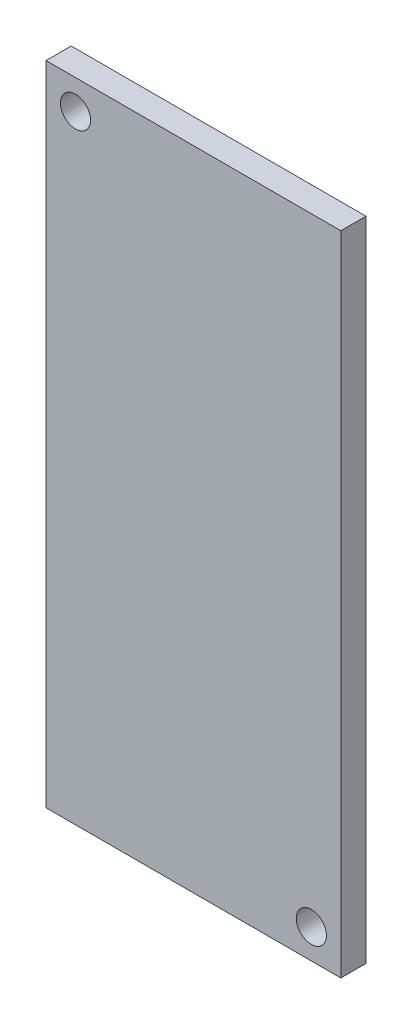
from build123d import *

# Parameters (mm, degrees)
SKETCH1_W          = 20.5
SKETCH1_H          = 45
EXTRUDE1_DEPTH     = 1.75
SKETCH2_R          = 1.05
CUT_EXTRUDE1_DEPTH = 1.75


with BuildPart() as part:
    # Sketch1 → Extrude1 (new body)
    with BuildSketch(Plane.XY):
        Rectangle(SKETCH1_W, SKETCH1_H)
    extrude(amount=EXTRUDE1_DEPTH)

    # Sketch2 → Cut-Extrude1 (cut)
    with BuildSketch(Plane.XY.offset(1.75)):
        with Locations((8.2, -20.45)):
            Circle(SKETCH2_R)
        with Locations((-8.2, 20.45)):
            Circle(SKETCH2_R)
    extrude(amount=-CUT_EXTRUDE1_DEPTH, mode=Mode.SUBTRACT)


solid = part.part
